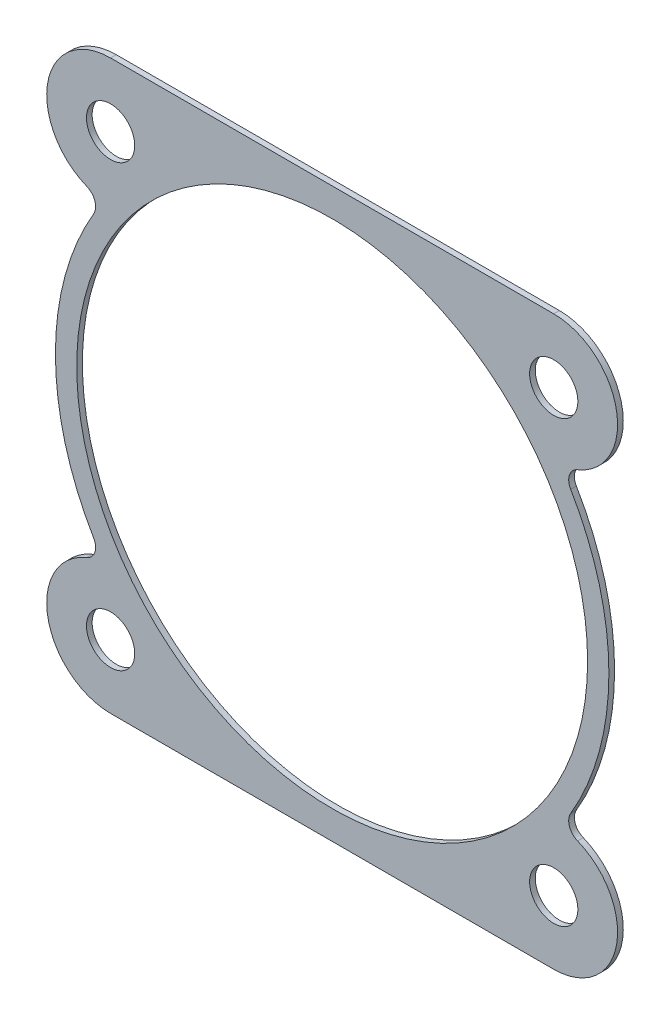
ISO-10303-21;
HEADER;
FILE_DESCRIPTION(('STEP AP214'),'2;1');
FILE_NAME('part.step','',(''),(''),'','','');
FILE_SCHEMA(('AUTOMOTIVE_DESIGN { 1 0 10303 214 1 1 1 1 }'));
ENDSEC;
DATA;
#1=APPLICATION_CONTEXT('core data for automotive mechanical design processes');
#2=APPLICATION_PROTOCOL_DEFINITION('international standard','automotive_design',2000,#1);
#3=PRODUCT_CONTEXT('',#1,'mechanical');
#4=PRODUCT('Part','Part','',(#3));
#5=PRODUCT_RELATED_PRODUCT_CATEGORY('part','',(#4));
#6=PRODUCT_DEFINITION_FORMATION('','',#4);
#7=PRODUCT_DEFINITION_CONTEXT('part definition',#1,'design');
#8=PRODUCT_DEFINITION('design','',#6,#7);
#9=PRODUCT_DEFINITION_SHAPE('','',#8);
#10=(LENGTH_UNIT() NAMED_UNIT(*) SI_UNIT(.MILLI.,.METRE.));
#11=(NAMED_UNIT(*) PLANE_ANGLE_UNIT() SI_UNIT($,.RADIAN.));
#12=(NAMED_UNIT(*) SI_UNIT($,.STERADIAN.) SOLID_ANGLE_UNIT());
#13=UNCERTAINTY_MEASURE_WITH_UNIT(LENGTH_MEASURE(1.E-05),#10,'distance_accuracy_value','');
#14=(GEOMETRIC_REPRESENTATION_CONTEXT(3) GLOBAL_UNCERTAINTY_ASSIGNED_CONTEXT((#13)) GLOBAL_UNIT_ASSIGNED_CONTEXT((#10,
#11,#12)) REPRESENTATION_CONTEXT('',''));
#15=CARTESIAN_POINT('',(0.,0.,0.));
#16=DIRECTION('',(0.,0.,1.));
#17=DIRECTION('',(1.,0.,0.));
#18=AXIS2_PLACEMENT_3D('',#15,#16,#17);
#19=CARTESIAN_POINT('',(-17.6671332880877,-10.398190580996,0.2));
#20=DIRECTION('',(0.,0.,-1.));
#21=DIRECTION('',(-1.,0.,0.));
#22=AXIS2_PLACEMENT_3D('',#19,#20,#21);
#23=CYLINDRICAL_SURFACE('',#22,0.99999968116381);
#24=CARTESIAN_POINT('',(-17.6671332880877,-10.398190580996,-0.2));
#25=DIRECTION('',(0.,0.,-1.));
#26=DIRECTION('',(-1.,0.,0.));
#27=AXIS2_PLACEMENT_3D('',#24,#25,#26);
#28=CIRCLE('',#27,0.99999968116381);
#29=CARTESIAN_POINT('',(-16.8053221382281,-9.89096193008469,-0.2));
#30=VERTEX_POINT('',#29);
#31=CARTESIAN_POINT('',(-17.2935626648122,-11.3257919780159,-0.2));
#32=VERTEX_POINT('',#31);
#33=EDGE_CURVE('E123',#30,#32,#28,.T.);
#34=ORIENTED_EDGE('',*,*,#33,.T.);
#35=DIRECTION('',(0.,0.,-1.));
#36=VECTOR('',#35,1.);
#37=CARTESIAN_POINT('',(-17.2935626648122,-11.3257919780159,0.2));
#38=LINE('',#37,#36);
#39=CARTESIAN_POINT('',(-17.2935626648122,-11.3257919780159,0.2));
#40=VERTEX_POINT('',#39);
#41=EDGE_CURVE('E11',#40,#32,#38,.T.);
#42=ORIENTED_EDGE('',*,*,#41,.F.);
#43=CARTESIAN_POINT('',(-17.6671332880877,-10.398190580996,0.2));
#44=DIRECTION('',(0.,0.,-1.));
#45=DIRECTION('',(-1.,0.,0.));
#46=AXIS2_PLACEMENT_3D('',#43,#44,#45);
#47=CIRCLE('',#46,0.99999968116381);
#48=CARTESIAN_POINT('',(-16.8053221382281,-9.89096193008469,0.2));
#49=VERTEX_POINT('',#48);
#50=EDGE_CURVE('E163',#49,#40,#47,.T.);
#51=ORIENTED_EDGE('',*,*,#50,.F.);
#52=DIRECTION('',(0.,0.,-1.));
#53=VECTOR('',#52,1.);
#54=CARTESIAN_POINT('',(-16.8053221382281,-9.89096193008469,0.2));
#55=LINE('',#54,#53);
#56=EDGE_CURVE('E136',#49,#30,#55,.T.);
#57=ORIENTED_EDGE('',*,*,#56,.T.);
#58=EDGE_LOOP('',(#34,#42,#51,#57));
#59=FACE_BOUND('',#58,.T.);
#60=ADVANCED_FACE('F31',(#59),#23,.F.);
#61=CARTESIAN_POINT('',(-15.6124942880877,-15.499999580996,0.2));
#62=DIRECTION('',(0.,0.,-1.));
#63=DIRECTION('',(-1.,0.,0.));
#64=AXIS2_PLACEMENT_3D('',#61,#62,#63);
#65=CYLINDRICAL_SURFACE('',#64,4.5);
#66=CARTESIAN_POINT('',(-15.6124942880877,-15.499999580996,-0.2));
#67=DIRECTION('',(0.,0.,1.));
#68=DIRECTION('',(-1.,0.,0.));
#69=AXIS2_PLACEMENT_3D('',#66,#67,#68);
#70=CIRCLE('',#69,4.5);
#71=CARTESIAN_POINT('',(-15.612495,-19.9999995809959,-0.2));
#72=VERTEX_POINT('',#71);
#73=EDGE_CURVE('E119',#32,#72,#70,.T.);
#74=ORIENTED_EDGE('',*,*,#73,.T.);
#75=DIRECTION('',(0.,0.,-1.));
#76=VECTOR('',#75,1.);
#77=CARTESIAN_POINT('',(-15.612495,-19.9999995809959,0.2));
#78=LINE('',#77,#76);
#79=CARTESIAN_POINT('',(-15.612495,-19.9999995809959,0.2));
#80=VERTEX_POINT('',#79);
#81=EDGE_CURVE('E38',#80,#72,#78,.T.);
#82=ORIENTED_EDGE('',*,*,#81,.F.);
#83=CARTESIAN_POINT('',(-15.6124942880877,-15.499999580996,0.2));
#84=DIRECTION('',(0.,0.,1.));
#85=DIRECTION('',(-1.,0.,0.));
#86=AXIS2_PLACEMENT_3D('',#83,#84,#85);
#87=CIRCLE('',#86,4.5);
#88=EDGE_CURVE('E132',#40,#80,#87,.T.);
#89=ORIENTED_EDGE('',*,*,#88,.F.);
#90=ORIENTED_EDGE('',*,*,#41,.T.);
#91=EDGE_LOOP('',(#74,#82,#89,#90));
#92=FACE_BOUND('',#91,.T.);
#93=ADVANCED_FACE('F131',(#92),#65,.T.);
#94=CARTESIAN_POINT('',(-15.612495,-19.9999995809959,0.2));
#95=DIRECTION('',(0.,1.,0.));
#96=DIRECTION('',(-1.,0.,0.));
#97=AXIS2_PLACEMENT_3D('',#94,#95,#96);
#98=PLANE('',#97);
#99=DIRECTION('',(1.,0.,0.));
#100=VECTOR('',#99,1.);
#101=CARTESIAN_POINT('',(-15.612495,-19.9999995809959,-0.2));
#102=LINE('',#101,#100);
#103=CARTESIAN_POINT('',(15.612495,-19.9999995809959,-0.2));
#104=VERTEX_POINT('',#103);
#105=EDGE_CURVE('E125',#72,#104,#102,.T.);
#106=ORIENTED_EDGE('',*,*,#105,.T.);
#107=DIRECTION('',(0.,0.,-1.));
#108=VECTOR('',#107,1.);
#109=CARTESIAN_POINT('',(15.612495,-19.9999995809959,0.2));
#110=LINE('',#109,#108);
#111=CARTESIAN_POINT('',(15.612495,-19.9999995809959,0.2));
#112=VERTEX_POINT('',#111);
#113=EDGE_CURVE('E209',#112,#104,#110,.T.);
#114=ORIENTED_EDGE('',*,*,#113,.F.);
#115=DIRECTION('',(1.,0.,0.));
#116=VECTOR('',#115,1.);
#117=CARTESIAN_POINT('',(-15.612495,-19.9999995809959,0.2));
#118=LINE('',#117,#116);
#119=EDGE_CURVE('E166',#80,#112,#118,.T.);
#120=ORIENTED_EDGE('',*,*,#119,.F.);
#121=ORIENTED_EDGE('',*,*,#81,.T.);
#122=EDGE_LOOP('',(#106,#114,#120,#121));
#123=FACE_BOUND('',#122,.T.);
#124=ADVANCED_FACE('F213',(#123),#98,.F.);
#125=CARTESIAN_POINT('',(15.6124942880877,-15.499999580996,0.2));
#126=DIRECTION('',(0.,0.,-1.));
#127=DIRECTION('',(-1.,0.,0.));
#128=AXIS2_PLACEMENT_3D('',#125,#126,#127);
#129=CYLINDRICAL_SURFACE('',#128,4.5);
#130=CARTESIAN_POINT('',(15.6124942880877,-15.499999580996,-0.2));
#131=DIRECTION('',(0.,0.,1.));
#132=DIRECTION('',(1.,0.,0.));
#133=AXIS2_PLACEMENT_3D('',#130,#131,#132);
#134=CIRCLE('',#133,4.5);
#135=CARTESIAN_POINT('',(17.2935626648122,-11.3257919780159,-0.2));
#136=VERTEX_POINT('',#135);
#137=EDGE_CURVE('E145',#104,#136,#134,.T.);
#138=ORIENTED_EDGE('',*,*,#137,.T.);
#139=DIRECTION('',(0.,0.,-1.));
#140=VECTOR('',#139,1.);
#141=CARTESIAN_POINT('',(17.2935626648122,-11.3257919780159,0.2));
#142=LINE('',#141,#140);
#143=CARTESIAN_POINT('',(17.2935626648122,-11.3257919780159,0.2));
#144=VERTEX_POINT('',#143);
#145=EDGE_CURVE('E206',#144,#136,#142,.T.);
#146=ORIENTED_EDGE('',*,*,#145,.F.);
#147=CARTESIAN_POINT('',(15.6124942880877,-15.499999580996,0.2));
#148=DIRECTION('',(0.,0.,1.));
#149=DIRECTION('',(1.,0.,0.));
#150=AXIS2_PLACEMENT_3D('',#147,#148,#149);
#151=CIRCLE('',#150,4.5);
#152=EDGE_CURVE('E168',#112,#144,#151,.T.);
#153=ORIENTED_EDGE('',*,*,#152,.F.);
#154=ORIENTED_EDGE('',*,*,#113,.T.);
#155=EDGE_LOOP('',(#138,#146,#153,#154));
#156=FACE_BOUND('',#155,.T.);
#157=ADVANCED_FACE('F221',(#156),#129,.T.);
#158=CARTESIAN_POINT('',(17.6671332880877,-10.398190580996,0.2));
#159=DIRECTION('',(0.,0.,-1.));
#160=DIRECTION('',(-1.,0.,0.));
#161=AXIS2_PLACEMENT_3D('',#158,#159,#160);
#162=CYLINDRICAL_SURFACE('',#161,0.99999968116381);
#163=CARTESIAN_POINT('',(17.6671332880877,-10.398190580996,-0.2));
#164=DIRECTION('',(0.,0.,-1.));
#165=DIRECTION('',(1.,0.,0.));
#166=AXIS2_PLACEMENT_3D('',#163,#164,#165);
#167=CIRCLE('',#166,0.99999968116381);
#168=CARTESIAN_POINT('',(16.8053221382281,-9.89096193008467,-0.2));
#169=VERTEX_POINT('',#168);
#170=EDGE_CURVE('E147',#136,#169,#167,.T.);
#171=ORIENTED_EDGE('',*,*,#170,.T.);
#172=DIRECTION('',(0.,0.,-1.));
#173=VECTOR('',#172,1.);
#174=CARTESIAN_POINT('',(16.8053221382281,-9.89096193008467,0.2));
#175=LINE('',#174,#173);
#176=CARTESIAN_POINT('',(16.8053221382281,-9.89096193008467,0.2));
#177=VERTEX_POINT('',#176);
#178=EDGE_CURVE('E203',#177,#169,#175,.T.);
#179=ORIENTED_EDGE('',*,*,#178,.F.);
#180=CARTESIAN_POINT('',(17.6671332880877,-10.398190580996,0.2));
#181=DIRECTION('',(0.,0.,-1.));
#182=DIRECTION('',(1.,0.,0.));
#183=AXIS2_PLACEMENT_3D('',#180,#181,#182);
#184=CIRCLE('',#183,0.99999968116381);
#185=EDGE_CURVE('E170',#144,#177,#184,.T.);
#186=ORIENTED_EDGE('',*,*,#185,.F.);
#187=ORIENTED_EDGE('',*,*,#145,.T.);
#188=EDGE_LOOP('',(#171,#179,#186,#187));
#189=FACE_BOUND('',#188,.T.);
#190=ADVANCED_FACE('F224',(#189),#162,.F.);
#191=CARTESIAN_POINT('',(0.,0.,0.2));
#192=DIRECTION('',(0.,0.,-1.));
#193=DIRECTION('',(-1.,0.,0.));
#194=AXIS2_PLACEMENT_3D('',#191,#192,#193);
#195=CYLINDRICAL_SURFACE('',#194,19.4999994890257);
#196=CARTESIAN_POINT('',(0.,0.,-0.2));
#197=DIRECTION('',(0.,0.,1.));
#198=DIRECTION('',(1.,0.,0.));
#199=AXIS2_PLACEMENT_3D('',#196,#197,#198);
#200=CIRCLE('',#199,19.4999994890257);
#201=CARTESIAN_POINT('',(16.8053225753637,9.89096118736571,-0.2));
#202=VERTEX_POINT('',#201);
#203=EDGE_CURVE('E149',#169,#202,#200,.T.);
#204=ORIENTED_EDGE('',*,*,#203,.T.);
#205=DIRECTION('',(0.,0.,-1.));
#206=VECTOR('',#205,1.);
#207=CARTESIAN_POINT('',(16.8053225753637,9.89096118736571,0.2));
#208=LINE('',#207,#206);
#209=CARTESIAN_POINT('',(16.8053225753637,9.89096118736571,0.2));
#210=VERTEX_POINT('',#209);
#211=EDGE_CURVE('E200',#210,#202,#208,.T.);
#212=ORIENTED_EDGE('',*,*,#211,.F.);
#213=CARTESIAN_POINT('',(0.,0.,0.2));
#214=DIRECTION('',(0.,0.,1.));
#215=DIRECTION('',(1.,0.,0.));
#216=AXIS2_PLACEMENT_3D('',#213,#214,#215);
#217=CIRCLE('',#216,19.4999994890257);
#218=EDGE_CURVE('E172',#177,#210,#217,.T.);
#219=ORIENTED_EDGE('',*,*,#218,.F.);
#220=ORIENTED_EDGE('',*,*,#178,.T.);
#221=EDGE_LOOP('',(#204,#212,#219,#220));
#222=FACE_BOUND('',#221,.T.);
#223=ADVANCED_FACE('F229',(#222),#195,.T.);
#224=CARTESIAN_POINT('',(17.667134,10.39819,0.2));
#225=DIRECTION('',(0.,0.,-1.));
#226=DIRECTION('',(-1.,0.,0.));
#227=AXIS2_PLACEMENT_3D('',#224,#225,#226);
#228=CYLINDRICAL_SURFACE('',#227,1.00000000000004);
#229=CARTESIAN_POINT('',(17.667134,10.39819,-0.2));
#230=DIRECTION('',(0.,0.,-1.));
#231=DIRECTION('',(1.,0.,0.));
#232=AXIS2_PLACEMENT_3D('',#229,#230,#231);
#233=CIRCLE('',#232,1.00000000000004);
#234=CARTESIAN_POINT('',(17.2935636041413,11.3257918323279,-0.2));
#235=VERTEX_POINT('',#234);
#236=EDGE_CURVE('E151',#202,#235,#233,.T.);
#237=ORIENTED_EDGE('',*,*,#236,.T.);
#238=DIRECTION('',(0.,0.,-1.));
#239=VECTOR('',#238,1.);
#240=CARTESIAN_POINT('',(17.2935636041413,11.3257918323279,0.2));
#241=LINE('',#240,#239);
#242=CARTESIAN_POINT('',(17.2935636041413,11.3257918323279,0.2));
#243=VERTEX_POINT('',#242);
#244=EDGE_CURVE('E197',#243,#235,#241,.T.);
#245=ORIENTED_EDGE('',*,*,#244,.F.);
#246=CARTESIAN_POINT('',(17.667134,10.39819,0.2));
#247=DIRECTION('',(0.,0.,-1.));
#248=DIRECTION('',(1.,0.,0.));
#249=AXIS2_PLACEMENT_3D('',#246,#247,#248);
#250=CIRCLE('',#249,1.00000000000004);
#251=EDGE_CURVE('E174',#210,#243,#250,.T.);
#252=ORIENTED_EDGE('',*,*,#251,.F.);
#253=ORIENTED_EDGE('',*,*,#211,.T.);
#254=EDGE_LOOP('',(#237,#245,#252,#253));
#255=FACE_BOUND('',#254,.T.);
#256=ADVANCED_FACE('F235',(#255),#228,.F.);
#257=CARTESIAN_POINT('',(15.6124952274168,15.499999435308,0.2));
#258=DIRECTION('',(0.,0.,-1.));
#259=DIRECTION('',(-1.,0.,0.));
#260=AXIS2_PLACEMENT_3D('',#257,#258,#259);
#261=CYLINDRICAL_SURFACE('',#260,4.5);
#262=CARTESIAN_POINT('',(15.6124952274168,15.499999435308,-0.2));
#263=DIRECTION('',(0.,0.,1.));
#264=DIRECTION('',(1.,0.,0.));
#265=AXIS2_PLACEMENT_3D('',#262,#263,#264);
#266=CIRCLE('',#265,4.5);
#267=CARTESIAN_POINT('',(15.6124952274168,19.999999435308,-0.2));
#268=VERTEX_POINT('',#267);
#269=EDGE_CURVE('E153',#235,#268,#266,.T.);
#270=ORIENTED_EDGE('',*,*,#269,.T.);
#271=DIRECTION('',(0.,0.,-1.));
#272=VECTOR('',#271,1.);
#273=CARTESIAN_POINT('',(15.6124952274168,19.999999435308,0.2));
#274=LINE('',#273,#272);
#275=CARTESIAN_POINT('',(15.6124952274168,19.999999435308,0.2));
#276=VERTEX_POINT('',#275);
#277=EDGE_CURVE('E194',#276,#268,#274,.T.);
#278=ORIENTED_EDGE('',*,*,#277,.F.);
#279=CARTESIAN_POINT('',(15.6124952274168,15.499999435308,0.2));
#280=DIRECTION('',(0.,0.,1.));
#281=DIRECTION('',(1.,0.,0.));
#282=AXIS2_PLACEMENT_3D('',#279,#280,#281);
#283=CIRCLE('',#282,4.5);
#284=EDGE_CURVE('E176',#243,#276,#283,.T.);
#285=ORIENTED_EDGE('',*,*,#284,.F.);
#286=ORIENTED_EDGE('',*,*,#244,.T.);
#287=EDGE_LOOP('',(#270,#278,#285,#286));
#288=FACE_BOUND('',#287,.T.);
#289=ADVANCED_FACE('F239',(#288),#261,.T.);
#290=CARTESIAN_POINT('',(15.6124952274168,19.999999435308,0.2));
#291=DIRECTION('',(-1.81500077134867E-08,-1.,0.));
#292=DIRECTION('',(1.,-1.81500077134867E-08,0.));
#293=AXIS2_PLACEMENT_3D('',#290,#291,#292);
#294=PLANE('',#293);
#295=DIRECTION('',(-1.,1.81500077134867E-08,0.));
#296=VECTOR('',#295,1.);
#297=CARTESIAN_POINT('',(15.6124952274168,19.999999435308,-0.2));
#298=LINE('',#297,#296);
#299=CARTESIAN_POINT('',(-15.6124951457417,19.9999997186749,-0.2));
#300=VERTEX_POINT('',#299);
#301=EDGE_CURVE('E155',#268,#300,#298,.T.);
#302=ORIENTED_EDGE('',*,*,#301,.T.);
#303=DIRECTION('',(0.,0.,-1.));
#304=VECTOR('',#303,1.);
#305=CARTESIAN_POINT('',(-15.6124951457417,19.9999997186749,0.2));
#306=LINE('',#305,#304);
#307=CARTESIAN_POINT('',(-15.6124951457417,19.9999997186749,0.2));
#308=VERTEX_POINT('',#307);
#309=EDGE_CURVE('E191',#308,#300,#306,.T.);
#310=ORIENTED_EDGE('',*,*,#309,.F.);
#311=DIRECTION('',(-1.,1.81500077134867E-08,0.));
#312=VECTOR('',#311,1.);
#313=CARTESIAN_POINT('',(15.6124952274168,19.999999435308,0.2));
#314=LINE('',#313,#312);
#315=EDGE_CURVE('E178',#276,#308,#314,.T.);
#316=ORIENTED_EDGE('',*,*,#315,.F.);
#317=ORIENTED_EDGE('',*,*,#277,.T.);
#318=EDGE_LOOP('',(#302,#310,#316,#317));
#319=FACE_BOUND('',#318,.T.);
#320=ADVANCED_FACE('F244',(#319),#294,.F.);
#321=CARTESIAN_POINT('',(-15.6124952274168,15.499999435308,0.2));
#322=DIRECTION('',(0.,0.,-1.));
#323=DIRECTION('',(-1.,0.,0.));
#324=AXIS2_PLACEMENT_3D('',#321,#322,#323);
#325=CYLINDRICAL_SURFACE('',#324,4.50000028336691);
#326=CARTESIAN_POINT('',(-15.6124952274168,15.499999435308,-0.2));
#327=DIRECTION('',(0.,0.,1.));
#328=DIRECTION('',(-1.,0.,0.));
#329=AXIS2_PLACEMENT_3D('',#326,#327,#328);
#330=CIRCLE('',#329,4.50000028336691);
#331=CARTESIAN_POINT('',(-17.2935636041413,11.3257918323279,-0.2));
#332=VERTEX_POINT('',#331);
#333=EDGE_CURVE('E157',#300,#332,#330,.T.);
#334=ORIENTED_EDGE('',*,*,#333,.T.);
#335=DIRECTION('',(0.,0.,-1.));
#336=VECTOR('',#335,1.);
#337=CARTESIAN_POINT('',(-17.2935636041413,11.3257918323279,0.2));
#338=LINE('',#337,#336);
#339=CARTESIAN_POINT('',(-17.2935636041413,11.3257918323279,0.2));
#340=VERTEX_POINT('',#339);
#341=EDGE_CURVE('E188',#340,#332,#338,.T.);
#342=ORIENTED_EDGE('',*,*,#341,.F.);
#343=CARTESIAN_POINT('',(-15.6124952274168,15.499999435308,0.2));
#344=DIRECTION('',(0.,0.,1.));
#345=DIRECTION('',(-1.,0.,0.));
#346=AXIS2_PLACEMENT_3D('',#343,#344,#345);
#347=CIRCLE('',#346,4.50000028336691);
#348=EDGE_CURVE('E180',#308,#340,#347,.T.);
#349=ORIENTED_EDGE('',*,*,#348,.F.);
#350=ORIENTED_EDGE('',*,*,#309,.T.);
#351=EDGE_LOOP('',(#334,#342,#349,#350));
#352=FACE_BOUND('',#351,.T.);
#353=ADVANCED_FACE('F248',(#352),#325,.T.);
#354=CARTESIAN_POINT('',(-17.667134,10.39819,0.2));
#355=DIRECTION('',(0.,0.,-1.));
#356=DIRECTION('',(-1.,0.,0.));
#357=AXIS2_PLACEMENT_3D('',#354,#355,#356);
#358=CYLINDRICAL_SURFACE('',#357,1.00000000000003);
#359=CARTESIAN_POINT('',(-17.667134,10.39819,-0.2));
#360=DIRECTION('',(0.,0.,-1.));
#361=DIRECTION('',(-1.,0.,0.));
#362=AXIS2_PLACEMENT_3D('',#359,#360,#361);
#363=CIRCLE('',#362,1.00000000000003);
#364=CARTESIAN_POINT('',(-16.8053225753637,9.8909611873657,-0.2));
#365=VERTEX_POINT('',#364);
#366=EDGE_CURVE('E159',#332,#365,#363,.T.);
#367=ORIENTED_EDGE('',*,*,#366,.T.);
#368=DIRECTION('',(0.,0.,-1.));
#369=VECTOR('',#368,1.);
#370=CARTESIAN_POINT('',(-16.8053225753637,9.8909611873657,0.2));
#371=LINE('',#370,#369);
#372=CARTESIAN_POINT('',(-16.8053225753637,9.8909611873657,0.2));
#373=VERTEX_POINT('',#372);
#374=EDGE_CURVE('E185',#373,#365,#371,.T.);
#375=ORIENTED_EDGE('',*,*,#374,.F.);
#376=CARTESIAN_POINT('',(-17.667134,10.39819,0.2));
#377=DIRECTION('',(0.,0.,-1.));
#378=DIRECTION('',(-1.,0.,0.));
#379=AXIS2_PLACEMENT_3D('',#376,#377,#378);
#380=CIRCLE('',#379,1.00000000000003);
#381=EDGE_CURVE('E50',#340,#373,#380,.T.);
#382=ORIENTED_EDGE('',*,*,#381,.F.);
#383=ORIENTED_EDGE('',*,*,#341,.T.);
#384=EDGE_LOOP('',(#367,#375,#382,#383));
#385=FACE_BOUND('',#384,.T.);
#386=ADVANCED_FACE('F252',(#385),#358,.F.);
#387=CARTESIAN_POINT('',(0.,0.,0.2));
#388=DIRECTION('',(0.,0.,-1.));
#389=DIRECTION('',(-1.,0.,0.));
#390=AXIS2_PLACEMENT_3D('',#387,#388,#389);
#391=CYLINDRICAL_SURFACE('',#390,19.4999994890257);
#392=CARTESIAN_POINT('',(0.,0.,-0.2));
#393=DIRECTION('',(0.,0.,1.));
#394=DIRECTION('',(-1.,0.,0.));
#395=AXIS2_PLACEMENT_3D('',#392,#393,#394);
#396=CIRCLE('',#395,19.4999994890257);
#397=EDGE_CURVE('E161',#365,#30,#396,.T.);
#398=ORIENTED_EDGE('',*,*,#397,.T.);
#399=ORIENTED_EDGE('',*,*,#56,.F.);
#400=CARTESIAN_POINT('',(0.,0.,0.2));
#401=DIRECTION('',(0.,0.,1.));
#402=DIRECTION('',(-1.,0.,0.));
#403=AXIS2_PLACEMENT_3D('',#400,#401,#402);
#404=CIRCLE('',#403,19.4999994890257);
#405=EDGE_CURVE('E45',#373,#49,#404,.T.);
#406=ORIENTED_EDGE('',*,*,#405,.F.);
#407=ORIENTED_EDGE('',*,*,#374,.T.);
#408=EDGE_LOOP('',(#398,#399,#406,#407));
#409=FACE_BOUND('',#408,.T.);
#410=ADVANCED_FACE('F254',(#409),#391,.T.);
#411=CARTESIAN_POINT('',(-17.6671332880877,-10.398190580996,0.2));
#412=DIRECTION('',(0.,0.,-1.));
#413=DIRECTION('',(-1.,0.,0.));
#414=AXIS2_PLACEMENT_3D('',#411,#412,#413);
#415=PLANE('',#414);
#416=CARTESIAN_POINT('',(0.,0.,0.2));
#417=DIRECTION('',(0.,0.,1.));
#418=DIRECTION('',(1.,0.,0.));
#419=AXIS2_PLACEMENT_3D('',#416,#417,#418);
#420=CIRCLE('',#419,18.);
#421=CARTESIAN_POINT('',(18.,0.,0.2));
#422=VERTEX_POINT('',#421);
#423=EDGE_CURVE('E373',#422,#422,#420,.T.);
#424=ORIENTED_EDGE('',*,*,#423,.F.);
#425=EDGE_LOOP('',(#424));
#426=FACE_BOUND('',#425,.T.);
#427=CARTESIAN_POINT('',(15.6124952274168,15.499999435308,0.200000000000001));
#428=DIRECTION('',(0.,0.,1.));
#429=DIRECTION('',(1.,0.,0.));
#430=AXIS2_PLACEMENT_3D('',#427,#428,#429);
#431=CIRCLE('',#430,1.69999999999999);
#432=CARTESIAN_POINT('',(17.3124952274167,15.499999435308,0.200000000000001));
#433=VERTEX_POINT('',#432);
#434=EDGE_CURVE('E375',#433,#433,#431,.T.);
#435=ORIENTED_EDGE('',*,*,#434,.F.);
#436=EDGE_LOOP('',(#435));
#437=FACE_BOUND('',#436,.T.);
#438=CARTESIAN_POINT('',(-15.6124952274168,15.499999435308,0.200000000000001));
#439=DIRECTION('',(0.,0.,1.));
#440=DIRECTION('',(1.,0.,0.));
#441=AXIS2_PLACEMENT_3D('',#438,#439,#440);
#442=CIRCLE('',#441,1.69999999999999);
#443=CARTESIAN_POINT('',(-13.9124952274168,15.499999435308,0.200000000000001));
#444=VERTEX_POINT('',#443);
#445=EDGE_CURVE('E383',#444,#444,#442,.T.);
#446=ORIENTED_EDGE('',*,*,#445,.F.);
#447=EDGE_LOOP('',(#446));
#448=FACE_BOUND('',#447,.T.);
#449=CARTESIAN_POINT('',(-15.6124942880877,-15.499999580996,0.200000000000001));
#450=DIRECTION('',(0.,0.,1.));
#451=DIRECTION('',(1.,0.,0.));
#452=AXIS2_PLACEMENT_3D('',#449,#450,#451);
#453=CIRCLE('',#452,1.69999999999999);
#454=CARTESIAN_POINT('',(-13.9124942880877,-15.499999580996,0.200000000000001));
#455=VERTEX_POINT('',#454);
#456=EDGE_CURVE('E389',#455,#455,#453,.T.);
#457=ORIENTED_EDGE('',*,*,#456,.F.);
#458=EDGE_LOOP('',(#457));
#459=FACE_BOUND('',#458,.T.);
#460=CARTESIAN_POINT('',(15.6124942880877,-15.499999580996,0.200000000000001));
#461=DIRECTION('',(0.,0.,1.));
#462=DIRECTION('',(1.,0.,0.));
#463=AXIS2_PLACEMENT_3D('',#460,#461,#462);
#464=CIRCLE('',#463,1.69999999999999);
#465=CARTESIAN_POINT('',(17.3124942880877,-15.499999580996,0.200000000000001));
#466=VERTEX_POINT('',#465);
#467=EDGE_CURVE('E140',#466,#466,#464,.T.);
#468=ORIENTED_EDGE('',*,*,#467,.F.);
#469=EDGE_LOOP('',(#468));
#470=FACE_BOUND('',#469,.T.);
#471=ORIENTED_EDGE('',*,*,#50,.T.);
#472=ORIENTED_EDGE('',*,*,#88,.T.);
#473=ORIENTED_EDGE('',*,*,#119,.T.);
#474=ORIENTED_EDGE('',*,*,#152,.T.);
#475=ORIENTED_EDGE('',*,*,#185,.T.);
#476=ORIENTED_EDGE('',*,*,#218,.T.);
#477=ORIENTED_EDGE('',*,*,#251,.T.);
#478=ORIENTED_EDGE('',*,*,#284,.T.);
#479=ORIENTED_EDGE('',*,*,#315,.T.);
#480=ORIENTED_EDGE('',*,*,#348,.T.);
#481=ORIENTED_EDGE('',*,*,#381,.T.);
#482=ORIENTED_EDGE('',*,*,#405,.T.);
#483=EDGE_LOOP('',(#471,#472,#473,#474,#475,#476,#477,#478,#479,#480,#481,#482));
#484=FACE_BOUND('',#483,.T.);
#485=ADVANCED_FACE('F216',(#426,#437,#448,#459,#470,#484),#415,.F.);
#486=CARTESIAN_POINT('',(-17.6671332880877,-10.398190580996,-0.2));
#487=DIRECTION('',(0.,0.,-1.));
#488=DIRECTION('',(-1.,0.,0.));
#489=AXIS2_PLACEMENT_3D('',#486,#487,#488);
#490=PLANE('',#489);
#491=CARTESIAN_POINT('',(0.,0.,-0.2));
#492=DIRECTION('',(0.,0.,1.));
#493=DIRECTION('',(1.,0.,0.));
#494=AXIS2_PLACEMENT_3D('',#491,#492,#493);
#495=CIRCLE('',#494,18.);
#496=CARTESIAN_POINT('',(18.,0.,-0.2));
#497=VERTEX_POINT('',#496);
#498=EDGE_CURVE('E370',#497,#497,#495,.T.);
#499=ORIENTED_EDGE('',*,*,#498,.T.);
#500=EDGE_LOOP('',(#499));
#501=FACE_BOUND('',#500,.T.);
#502=CARTESIAN_POINT('',(15.6124952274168,15.499999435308,-0.2));
#503=DIRECTION('',(0.,0.,1.));
#504=DIRECTION('',(1.,0.,0.));
#505=AXIS2_PLACEMENT_3D('',#502,#503,#504);
#506=CIRCLE('',#505,1.7);
#507=CARTESIAN_POINT('',(17.3124952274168,15.499999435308,-0.2));
#508=VERTEX_POINT('',#507);
#509=EDGE_CURVE('E380',#508,#508,#506,.T.);
#510=ORIENTED_EDGE('',*,*,#509,.T.);
#511=EDGE_LOOP('',(#510));
#512=FACE_BOUND('',#511,.T.);
#513=CARTESIAN_POINT('',(-15.6124952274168,15.499999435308,-0.2));
#514=DIRECTION('',(0.,0.,1.));
#515=DIRECTION('',(1.,0.,0.));
#516=AXIS2_PLACEMENT_3D('',#513,#514,#515);
#517=CIRCLE('',#516,1.7);
#518=CARTESIAN_POINT('',(-13.9124952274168,15.499999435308,-0.2));
#519=VERTEX_POINT('',#518);
#520=EDGE_CURVE('E386',#519,#519,#517,.T.);
#521=ORIENTED_EDGE('',*,*,#520,.T.);
#522=EDGE_LOOP('',(#521));
#523=FACE_BOUND('',#522,.T.);
#524=CARTESIAN_POINT('',(-15.6124942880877,-15.499999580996,-0.2));
#525=DIRECTION('',(0.,0.,1.));
#526=DIRECTION('',(1.,0.,0.));
#527=AXIS2_PLACEMENT_3D('',#524,#525,#526);
#528=CIRCLE('',#527,1.7);
#529=CARTESIAN_POINT('',(-13.9124942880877,-15.499999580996,-0.2));
#530=VERTEX_POINT('',#529);
#531=EDGE_CURVE('E392',#530,#530,#528,.T.);
#532=ORIENTED_EDGE('',*,*,#531,.T.);
#533=EDGE_LOOP('',(#532));
#534=FACE_BOUND('',#533,.T.);
#535=CARTESIAN_POINT('',(15.6124942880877,-15.499999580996,-0.2));
#536=DIRECTION('',(0.,0.,1.));
#537=DIRECTION('',(1.,0.,0.));
#538=AXIS2_PLACEMENT_3D('',#535,#536,#537);
#539=CIRCLE('',#538,1.7);
#540=CARTESIAN_POINT('',(17.3124942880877,-15.499999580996,-0.2));
#541=VERTEX_POINT('',#540);
#542=EDGE_CURVE('E137',#541,#541,#539,.T.);
#543=ORIENTED_EDGE('',*,*,#542,.T.);
#544=EDGE_LOOP('',(#543));
#545=FACE_BOUND('',#544,.T.);
#546=ORIENTED_EDGE('',*,*,#33,.F.);
#547=ORIENTED_EDGE('',*,*,#397,.F.);
#548=ORIENTED_EDGE('',*,*,#366,.F.);
#549=ORIENTED_EDGE('',*,*,#333,.F.);
#550=ORIENTED_EDGE('',*,*,#301,.F.);
#551=ORIENTED_EDGE('',*,*,#269,.F.);
#552=ORIENTED_EDGE('',*,*,#236,.F.);
#553=ORIENTED_EDGE('',*,*,#203,.F.);
#554=ORIENTED_EDGE('',*,*,#170,.F.);
#555=ORIENTED_EDGE('',*,*,#137,.F.);
#556=ORIENTED_EDGE('',*,*,#105,.F.);
#557=ORIENTED_EDGE('',*,*,#73,.F.);
#558=EDGE_LOOP('',(#546,#547,#548,#549,#550,#551,#552,#553,#554,#555,#556,#557));
#559=FACE_BOUND('',#558,.T.);
#560=ADVANCED_FACE('F120',(#501,#512,#523,#534,#545,#559),#490,.T.);
#561=CARTESIAN_POINT('',(15.6124942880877,-15.499999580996,0.2));
#562=DIRECTION('',(0.,0.,1.));
#563=DIRECTION('',(1.,0.,0.));
#564=AXIS2_PLACEMENT_3D('',#561,#562,#563);
#565=CYLINDRICAL_SURFACE('',#564,1.69999999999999);
#566=ORIENTED_EDGE('',*,*,#542,.F.);
#567=EDGE_LOOP('',(#566));
#568=FACE_BOUND('',#567,.T.);
#569=ORIENTED_EDGE('',*,*,#467,.T.);
#570=EDGE_LOOP('',(#569));
#571=FACE_BOUND('',#570,.T.);
#572=ADVANCED_FACE('F313',(#568,#571),#565,.F.);
#573=CARTESIAN_POINT('',(-15.6124942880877,-15.499999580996,0.2));
#574=DIRECTION('',(0.,0.,1.));
#575=DIRECTION('',(1.,0.,0.));
#576=AXIS2_PLACEMENT_3D('',#573,#574,#575);
#577=CYLINDRICAL_SURFACE('',#576,1.69999999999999);
#578=ORIENTED_EDGE('',*,*,#531,.F.);
#579=EDGE_LOOP('',(#578));
#580=FACE_BOUND('',#579,.T.);
#581=ORIENTED_EDGE('',*,*,#456,.T.);
#582=EDGE_LOOP('',(#581));
#583=FACE_BOUND('',#582,.T.);
#584=ADVANCED_FACE('F323',(#580,#583),#577,.F.);
#585=CARTESIAN_POINT('',(-15.6124952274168,15.499999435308,0.2));
#586=DIRECTION('',(0.,0.,1.));
#587=DIRECTION('',(1.,0.,0.));
#588=AXIS2_PLACEMENT_3D('',#585,#586,#587);
#589=CYLINDRICAL_SURFACE('',#588,1.69999999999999);
#590=ORIENTED_EDGE('',*,*,#520,.F.);
#591=EDGE_LOOP('',(#590));
#592=FACE_BOUND('',#591,.T.);
#593=ORIENTED_EDGE('',*,*,#445,.T.);
#594=EDGE_LOOP('',(#593));
#595=FACE_BOUND('',#594,.T.);
#596=ADVANCED_FACE('F333',(#592,#595),#589,.F.);
#597=CARTESIAN_POINT('',(15.6124952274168,15.499999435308,0.2));
#598=DIRECTION('',(0.,0.,1.));
#599=DIRECTION('',(1.,0.,0.));
#600=AXIS2_PLACEMENT_3D('',#597,#598,#599);
#601=CYLINDRICAL_SURFACE('',#600,1.69999999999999);
#602=ORIENTED_EDGE('',*,*,#509,.F.);
#603=EDGE_LOOP('',(#602));
#604=FACE_BOUND('',#603,.T.);
#605=ORIENTED_EDGE('',*,*,#434,.T.);
#606=EDGE_LOOP('',(#605));
#607=FACE_BOUND('',#606,.T.);
#608=ADVANCED_FACE('F343',(#604,#607),#601,.F.);
#609=CARTESIAN_POINT('',(0.,0.,-0.2));
#610=DIRECTION('',(0.,0.,1.));
#611=DIRECTION('',(1.,0.,0.));
#612=AXIS2_PLACEMENT_3D('',#609,#610,#611);
#613=CYLINDRICAL_SURFACE('',#612,18.);
#614=ORIENTED_EDGE('',*,*,#498,.F.);
#615=EDGE_LOOP('',(#614));
#616=FACE_BOUND('',#615,.T.);
#617=ORIENTED_EDGE('',*,*,#423,.T.);
#618=EDGE_LOOP('',(#617));
#619=FACE_BOUND('',#618,.T.);
#620=ADVANCED_FACE('F353',(#616,#619),#613,.F.);
#621=CLOSED_SHELL('',(#60,#93,#124,#157,#190,#223,#256,#289,#320,#353,#386,#410,#485,#560,#572,
#584,#596,#608,#620));
#622=MANIFOLD_SOLID_BREP('B2',#621);
#623=ADVANCED_BREP_SHAPE_REPRESENTATION('',(#18,#622),#14);
#624=SHAPE_DEFINITION_REPRESENTATION(#9,#623);
ENDSEC;
END-ISO-10303-21;
